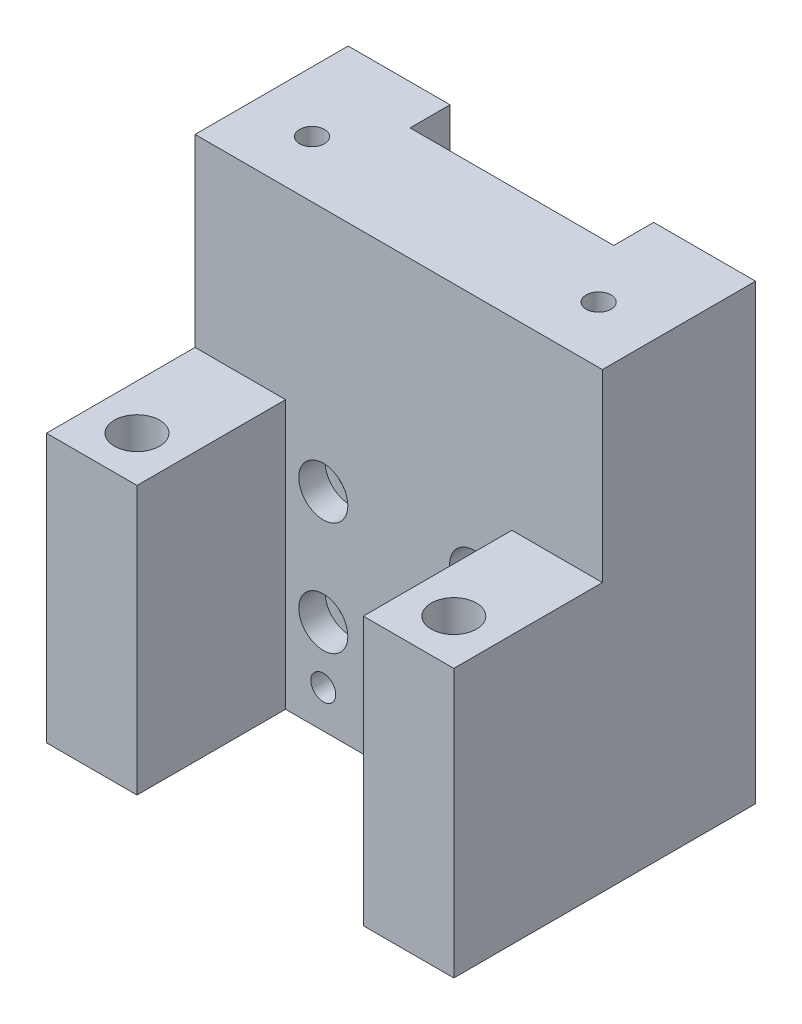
from build123d import *

# Parameters (mm, degrees)
SKETCH_1_W          = 54
SKETCH_1_H          = 60
SKETCH_1_R          = 1.75
SKETCH_1_R_2        = 1.65
EXTRUDE_1_DEPTH     = 40
CUT_EXTRUDE_4_DEPTH = 91.088845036
SKETCH_3_OUTSIDE_W  = 74.018
SKETCH_3_OUTSIDE_H  = 60.018
CUT_EXTRUDE_5_DEPTH = 91.088845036
SKETCH_4_R          = 3.25
CUT_EXTRUDE_6_DEPTH = 3.5
SKETCH_5_R          = 1.65
CUT_EXTRUDE_7_DEPTH = 12
SKETCH_6_R          = 3
CUT_EXTRUDE_8_DEPTH = 77.024565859


with BuildPart() as part:
    # Sketch 1 → Extrude 1 (new body)
    with BuildSketch(Plane.XY):
        with Locations((27, 30)):
            Rectangle(SKETCH_1_W, SKETCH_1_H)
        with Locations((17, 12.5)):
            Circle(SKETCH_1_R, mode=Mode.SUBTRACT)
        with Locations((37, 12.5)):
            Circle(SKETCH_1_R, mode=Mode.SUBTRACT)
        with Locations((37, 27.5)):
            Circle(SKETCH_1_R, mode=Mode.SUBTRACT)
        with Locations((17, 27.5)):
            Circle(SKETCH_1_R, mode=Mode.SUBTRACT)
        with Locations((17, 5)):
            Circle(SKETCH_1_R_2, mode=Mode.SUBTRACT)
        with Locations((37, 5)):
            Circle(SKETCH_1_R_2, mode=Mode.SUBTRACT)
    extrude(amount=EXTRUDE_1_DEPTH)

    # Sketch 2 → Cut-Extrude 4 (cut, through all)
    with BuildSketch(Plane(origin=(54, 0, 0), x_dir=(0, 0, -1), z_dir=(1, 0, 0))):
        Polygon((-20.3, 35.549045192), (-20.3, 59.549045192), (-20.3, 60), (-40, 60), (-40, 35.549045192), align=None)
    extrude(amount=-CUT_EXTRUDE_4_DEPTH, mode=Mode.SUBTRACT)

    # Sketch 3 outside → Cut-Extrude 5 (cut, through all)
    with BuildSketch(Plane(origin=(0, 60, 0), x_dir=(1, 0, 0), z_dir=(0, 1, 0))):
        with Locations((27, -20)):
            Rectangle(SKETCH_3_OUTSIDE_W, SKETCH_3_OUTSIDE_H)
        Polygon((0, -40), (12, -40), (12, -20.3), (42, -20.3), (42, -40), (54, -40), (54, 0), (40.5, 0), (40.5, -5.3), (13.5, -5.3), (13.5, 0), (0, 0), align=None, mode=Mode.SUBTRACT)
    extrude(amount=-CUT_EXTRUDE_5_DEPTH, mode=Mode.SUBTRACT)

    # Sketch 4 → Cut-Extrude 6 (cut)
    with BuildSketch(Plane.XY.offset(20.3)):
        with Locations((17, 12.5)):
            Circle(SKETCH_4_R)
        with Locations((37, 12.5)):
            Circle(SKETCH_4_R)
        with Locations((37, 27.5)):
            Circle(SKETCH_4_R)
        with Locations((17, 27.5)):
            Circle(SKETCH_4_R)
    extrude(amount=-CUT_EXTRUDE_6_DEPTH, mode=Mode.SUBTRACT)

    # Sketch 5 → Cut-Extrude 7 (cut)
    with BuildSketch(Plane(origin=(0, 60, 0), x_dir=(1, 0, 0), z_dir=(0, 1, 0))):
        with Locations(Location((8, -12.8, 0), (0, 0, 270))):
            Circle(SKETCH_5_R)
        with Locations(Location((46, -12.8, 0), (0, 0, 270))):
            Circle(SKETCH_5_R)
    extrude(amount=-CUT_EXTRUDE_7_DEPTH, mode=Mode.SUBTRACT)

    # Sketch 6 → Cut-Extrude 8 (cut, through all)
    with BuildSketch(Plane(origin=(0, 35.549045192, 0), x_dir=(1, 0, 0), z_dir=(0, 1, 0))):
        with Locations(Location((6, -34, 0), (0, 0, 270))):
            Circle(SKETCH_6_R)
        with Locations(Location((48, -34, 0), (0, 0, 270))):
            Circle(SKETCH_6_R)
    extrude(amount=-CUT_EXTRUDE_8_DEPTH, mode=Mode.SUBTRACT)


solid = part.part
